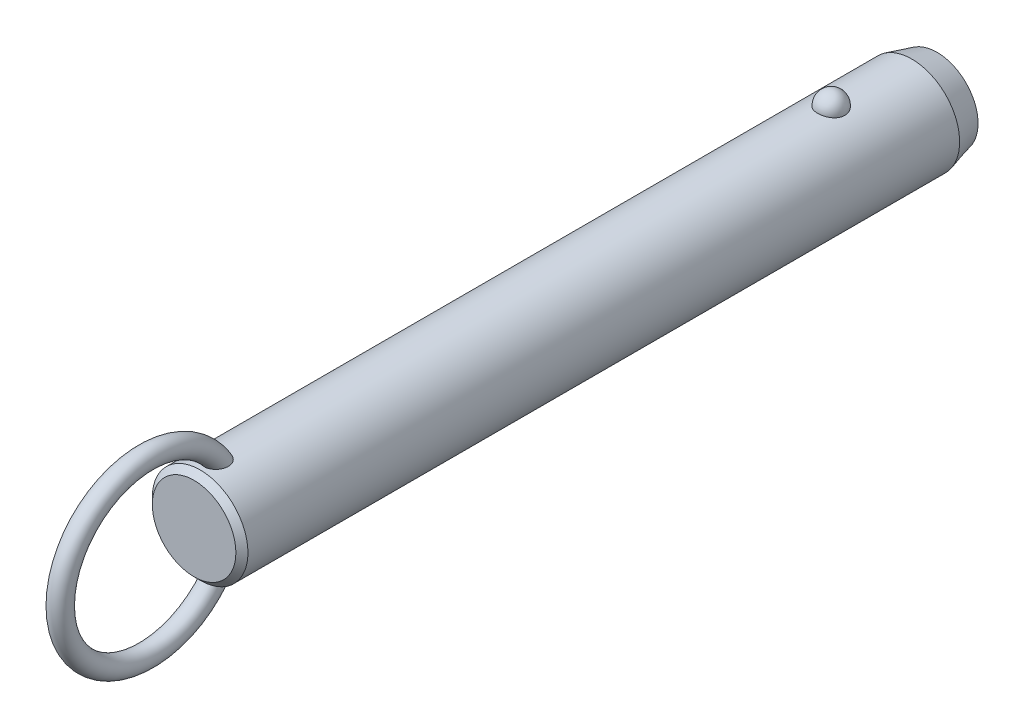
ISO-10303-21;
HEADER;
FILE_DESCRIPTION(('STEP AP214'),'2;1');
FILE_NAME('part.step','',(''),(''),'','','');
FILE_SCHEMA(('AUTOMOTIVE_DESIGN { 1 0 10303 214 1 1 1 1 }'));
ENDSEC;
DATA;
#1=APPLICATION_CONTEXT('core data for automotive mechanical design processes');
#2=APPLICATION_PROTOCOL_DEFINITION('international standard','automotive_design',2000,#1);
#3=PRODUCT_CONTEXT('',#1,'mechanical');
#4=PRODUCT('Part','Part','',(#3));
#5=PRODUCT_RELATED_PRODUCT_CATEGORY('part','',(#4));
#6=PRODUCT_DEFINITION_FORMATION('','',#4);
#7=PRODUCT_DEFINITION_CONTEXT('part definition',#1,'design');
#8=PRODUCT_DEFINITION('design','',#6,#7);
#9=PRODUCT_DEFINITION_SHAPE('','',#8);
#10=(LENGTH_UNIT() NAMED_UNIT(*) SI_UNIT(.MILLI.,.METRE.));
#11=(NAMED_UNIT(*) PLANE_ANGLE_UNIT() SI_UNIT($,.RADIAN.));
#12=(NAMED_UNIT(*) SI_UNIT($,.STERADIAN.) SOLID_ANGLE_UNIT());
#13=UNCERTAINTY_MEASURE_WITH_UNIT(LENGTH_MEASURE(1.E-05),#10,'distance_accuracy_value','');
#14=(GEOMETRIC_REPRESENTATION_CONTEXT(3) GLOBAL_UNCERTAINTY_ASSIGNED_CONTEXT((#13)) GLOBAL_UNIT_ASSIGNED_CONTEXT((#10,
#11,#12)) REPRESENTATION_CONTEXT('',''));
#15=CARTESIAN_POINT('',(0.,0.,0.));
#16=DIRECTION('',(0.,0.,1.));
#17=DIRECTION('',(1.,0.,0.));
#18=AXIS2_PLACEMENT_3D('',#15,#16,#17);
#19=CARTESIAN_POINT('',(0.,0.,114.3));
#20=DIRECTION('',(0.,0.,-1.));
#21=DIRECTION('',(-1.,0.,0.));
#22=AXIS2_PLACEMENT_3D('',#19,#20,#21);
#23=CYLINDRICAL_SURFACE('',#22,9.5);
#24=CARTESIAN_POINT('',(2.67259918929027,9.11631578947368,-2.70000000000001));
#25=CARTESIAN_POINT('',(2.6725968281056,9.11631786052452,-2.54909854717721));
#26=CARTESIAN_POINT('',(2.66030567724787,9.11994722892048,-2.39816735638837));
#27=CARTESIAN_POINT('',(2.6114347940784,9.13405924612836,-2.10058568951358));
#28=CARTESIAN_POINT('',(2.57484658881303,9.14454428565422,-1.95393672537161));
#29=CARTESIAN_POINT('',(2.47830875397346,9.17117631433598,-1.66916069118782));
#30=CARTESIAN_POINT('',(2.41836936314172,9.18732082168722,-1.53102991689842));
#31=CARTESIAN_POINT('',(2.27661331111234,9.22346780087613,-1.26705393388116));
#32=CARTESIAN_POINT('',(2.19479699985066,9.24347021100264,-1.14120852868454));
#33=CARTESIAN_POINT('',(2.01085282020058,9.28522401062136,-0.904632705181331));
#34=CARTESIAN_POINT('',(1.90862396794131,9.30698376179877,-0.793982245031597));
#35=CARTESIAN_POINT('',(1.6867437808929,9.34973971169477,-0.591607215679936));
#36=CARTESIAN_POINT('',(1.56709244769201,9.37073591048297,-0.499882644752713));
#37=CARTESIAN_POINT('',(1.31393976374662,9.40956370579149,-0.338167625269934));
#38=CARTESIAN_POINT('',(1.18048026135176,9.42740444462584,-0.268113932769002));
#39=CARTESIAN_POINT('',(0.903154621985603,9.45799906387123,-0.151390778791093));
#40=CARTESIAN_POINT('',(0.759289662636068,9.47075351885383,-0.104718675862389));
#41=CARTESIAN_POINT('',(0.468074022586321,9.48956256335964,-0.0367633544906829));
#42=CARTESIAN_POINT('',(0.320836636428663,9.49573643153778,-0.0150275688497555));
#43=CARTESIAN_POINT('',(0.0246714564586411,9.50112183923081,0.00396199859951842));
#44=CARTESIAN_POINT('',(-0.124256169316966,9.50033406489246,0.00121819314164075));
#45=CARTESIAN_POINT('',(-0.417264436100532,9.4919475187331,-0.0284441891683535));
#46=CARTESIAN_POINT('',(-0.56138413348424,9.48444885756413,-0.0550074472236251));
#47=CARTESIAN_POINT('',(-0.842986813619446,9.46357853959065,-0.131064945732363));
#48=CARTESIAN_POINT('',(-0.980469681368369,9.450206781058,-0.180559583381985));
#49=CARTESIAN_POINT('',(-1.24585005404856,9.41890822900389,-0.301476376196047));
#50=CARTESIAN_POINT('',(-1.37368611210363,9.40095498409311,-0.373026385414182));
#51=CARTESIAN_POINT('',(-1.61552738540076,9.36242964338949,-0.536025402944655));
#52=CARTESIAN_POINT('',(-1.72953116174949,9.34185727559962,-0.627476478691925));
#53=CARTESIAN_POINT('',(-1.9429225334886,9.29984568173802,-0.829844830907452));
#54=CARTESIAN_POINT('',(-2.04198021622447,9.27839736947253,-0.94110821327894));
#55=CARTESIAN_POINT('',(-2.22026460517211,9.23735994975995,-1.17883414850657));
#56=CARTESIAN_POINT('',(-2.29948985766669,9.21777097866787,-1.30529781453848));
#57=CARTESIAN_POINT('',(-2.43697287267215,9.18238994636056,-1.57158566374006));
#58=CARTESIAN_POINT('',(-2.49497068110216,9.16664569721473,-1.71155057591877));
#59=CARTESIAN_POINT('',(-2.5872073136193,9.14104303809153,-1.99961197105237));
#60=CARTESIAN_POINT('',(-2.62144683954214,9.13118445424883,-2.14770821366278));
#61=CARTESIAN_POINT('',(-2.66521466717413,9.11850622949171,-2.44715424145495));
#62=CARTESIAN_POINT('',(-2.67484831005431,9.11565658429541,-2.59848735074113));
#63=CARTESIAN_POINT('',(-2.66946735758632,9.11723375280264,-2.90067317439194));
#64=CARTESIAN_POINT('',(-2.65445345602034,9.12166036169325,-3.05152590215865));
#65=CARTESIAN_POINT('',(-2.60029711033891,9.13724422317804,-3.34766110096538));
#66=CARTESIAN_POINT('',(-2.56127978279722,9.14836656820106,-3.49296833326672));
#67=CARTESIAN_POINT('',(-2.46018844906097,9.17606676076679,-3.77477535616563));
#68=CARTESIAN_POINT('',(-2.39811349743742,9.1926448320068,-3.9112747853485));
#69=CARTESIAN_POINT('',(-2.25202303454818,9.22952198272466,-4.17244273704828));
#70=CARTESIAN_POINT('',(-2.16788714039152,9.24984129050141,-4.29704106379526));
#71=CARTESIAN_POINT('',(-1.9799408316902,9.29188255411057,-4.53013066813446));
#72=CARTESIAN_POINT('',(-1.87612963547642,9.31360456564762,-4.63862130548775));
#73=CARTESIAN_POINT('',(-1.65105429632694,9.35612959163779,-4.8369029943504));
#74=CARTESIAN_POINT('',(-1.52972405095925,9.37692871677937,-4.92661991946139));
#75=CARTESIAN_POINT('',(-1.27318250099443,9.41518970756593,-5.08429106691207));
#76=CARTESIAN_POINT('',(-1.13797219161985,9.432651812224,-5.15224684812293));
#77=CARTESIAN_POINT('',(-0.859280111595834,9.46208255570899,-5.26371827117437));
#78=CARTESIAN_POINT('',(-0.715925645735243,9.47411833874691,-5.30753421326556));
#79=CARTESIAN_POINT('',(-0.423550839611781,9.4916822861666,-5.37076321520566));
#80=CARTESIAN_POINT('',(-0.2745312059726,9.49721125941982,-5.39017930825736));
#81=CARTESIAN_POINT('',(0.0218446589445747,9.50110860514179,-5.40390587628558));
#82=CARTESIAN_POINT('',(0.16917707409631,9.49961381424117,-5.39869609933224));
#83=CARTESIAN_POINT('',(0.460808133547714,9.48993906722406,-5.36441955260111));
#84=CARTESIAN_POINT('',(0.605106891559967,9.48175936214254,-5.33535367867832));
#85=CARTESIAN_POINT('',(0.886027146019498,9.4596376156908,-5.25435587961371));
#86=CARTESIAN_POINT('',(1.02267710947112,9.44571881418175,-5.20251612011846));
#87=CARTESIAN_POINT('',(1.28523827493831,9.41358993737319,-5.07741549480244));
#88=CARTESIAN_POINT('',(1.41114877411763,9.39537958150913,-5.00415322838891));
#89=CARTESIAN_POINT('',(1.65085227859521,9.3562644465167,-4.83684599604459));
#90=CARTESIAN_POINT('',(1.76442346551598,9.33532178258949,-4.74249218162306));
#91=CARTESIAN_POINT('',(1.97425672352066,9.29321198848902,-4.53620389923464));
#92=CARTESIAN_POINT('',(2.07051582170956,9.27204482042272,-4.42426641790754));
#93=CARTESIAN_POINT('',(2.24490086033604,9.23139221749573,-4.18363183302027));
#94=CARTESIAN_POINT('',(2.32267019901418,9.21194380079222,-4.05466990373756));
#95=CARTESIAN_POINT('',(2.45584092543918,9.1773419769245,-3.78517836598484));
#96=CARTESIAN_POINT('',(2.5112497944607,9.16218713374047,-3.64465264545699));
#97=CARTESIAN_POINT('',(2.59380876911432,9.13913522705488,-3.37104301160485));
#98=CARTESIAN_POINT('',(2.62330266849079,9.13064624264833,-3.23871053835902));
#99=CARTESIAN_POINT('',(2.66269870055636,9.11923566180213,-2.97092664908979));
#100=CARTESIAN_POINT('',(2.67260130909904,9.11631393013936,-2.83547530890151));
#101=CARTESIAN_POINT('',(2.67259918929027,9.11631578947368,-2.70000000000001));
#102=B_SPLINE_CURVE_WITH_KNOTS('',3,(#24,#25,#26,#27,#28,#29,#30,#31,#32,#33,#34,#35,#36,#37,
#38,#39,#40,#41,#42,#43,#44,#45,#46,#47,#48,#49,#50,#51,#52,#53,#54,#55,#56,#57,#58,#59,#60,#61,
#62,#63,#64,#65,#66,#67,#68,#69,#70,#71,#72,#73,#74,#75,#76,#77,#78,#79,#80,#81,#82,#83,#84,#85,
#86,#87,#88,#89,#90,#91,#92,#93,#94,#95,#96,#97,#98,#99,#100,#101),.UNSPECIFIED.,.T.,.F.,(4,2,2,
2,2,2,2,2,2,2,2,2,2,2,2,2,2,2,2,2,2,2,2,2,2,2,2,2,2,2,2,2,2,2,2,2,2,2,4),(0.,0.452217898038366,
0.904593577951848,1.35677112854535,1.80894144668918,2.26340676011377,2.71787203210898,
3.17099820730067,3.62407318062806,4.0687883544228,4.51345969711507,4.95160616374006,
5.38976021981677,5.83050358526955,6.27129275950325,6.72071308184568,7.17016633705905,
7.62495278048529,8.07972578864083,8.53254856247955,8.98535859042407,9.43582813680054,
9.88631615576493,10.3393155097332,10.7923328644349,11.2471065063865,11.7018475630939,
12.150795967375,12.599688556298,13.0398725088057,13.4800399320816,13.9184421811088,
14.3568730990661,14.802202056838,15.2476074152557,15.7010097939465,16.1542603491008,
16.5602594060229,16.966248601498),.UNSPECIFIED.);
#103=CARTESIAN_POINT('',(2.67259918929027,9.11631578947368,-2.70000000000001));
#104=VERTEX_POINT('',#103);
#105=EDGE_CURVE('E41',#104,#104,#102,.T.);
#106=ORIENTED_EDGE('',*,*,#105,.T.);
#107=EDGE_LOOP('',(#106));
#108=FACE_BOUND('',#107,.T.);
#109=CARTESIAN_POINT('',(0.,0.,122.62));
#110=DIRECTION('',(0.,0.,1.));
#111=DIRECTION('',(1.,0.,0.));
#112=AXIS2_PLACEMENT_3D('',#109,#110,#111);
#113=CIRCLE('',#112,9.5);
#114=CARTESIAN_POINT('',(9.5,0.,122.62));
#115=VERTEX_POINT('',#114);
#116=EDGE_CURVE('E10',#115,#115,#113,.F.);
#117=ORIENTED_EDGE('',*,*,#116,.T.);
#118=EDGE_LOOP('',(#117));
#119=FACE_BOUND('',#118,.T.);
#120=CARTESIAN_POINT('',(-0.697062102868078,-9.47439269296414,116.967808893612));
#121=CARTESIAN_POINT('',(-0.799579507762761,-9.46685146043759,117.007482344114));
#122=CARTESIAN_POINT('',(-0.898575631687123,-9.45788043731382,117.0559309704));
#123=CARTESIAN_POINT('',(-1.08670047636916,-9.43811593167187,117.168868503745));
#124=CARTESIAN_POINT('',(-1.17583204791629,-9.42732297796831,117.233352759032));
#125=CARTESIAN_POINT('',(-1.34179806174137,-9.40513672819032,117.376209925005));
#126=CARTESIAN_POINT('',(-1.41865133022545,-9.39374438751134,117.454561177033));
#127=CARTESIAN_POINT('',(-1.55860047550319,-9.37154196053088,117.622752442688));
#128=CARTESIAN_POINT('',(-1.62169476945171,-9.3607319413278,117.71259377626));
#129=CARTESIAN_POINT('',(-1.73527695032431,-9.34035749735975,117.904500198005));
#130=CARTESIAN_POINT('',(-1.78522266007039,-9.33085270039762,118.006891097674));
#131=CARTESIAN_POINT('',(-1.86924997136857,-9.3143834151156,118.218148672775));
#132=CARTESIAN_POINT('',(-1.90332570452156,-9.30741986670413,118.327017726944));
#133=CARTESIAN_POINT('',(-1.95893603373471,-9.29588482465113,118.560473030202));
#134=CARTESIAN_POINT('',(-1.97872420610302,-9.29165182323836,118.685489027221));
#135=CARTESIAN_POINT('',(-2.00062129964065,-9.28695978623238,118.937080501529));
#136=CARTESIAN_POINT('',(-2.00272284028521,-9.28650232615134,119.063656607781));
#137=CARTESIAN_POINT('',(-1.98958876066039,-9.28932750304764,119.336815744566));
#138=CARTESIAN_POINT('',(-1.97143366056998,-9.2932400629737,119.483251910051));
#139=CARTESIAN_POINT('',(-1.91479925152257,-9.30507151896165,119.772062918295));
#140=CARTESIAN_POINT('',(-1.87629122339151,-9.31299607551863,119.914431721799));
#141=CARTESIAN_POINT('',(-1.7722568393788,-9.33340232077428,120.215172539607));
#142=CARTESIAN_POINT('',(-1.70334898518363,-9.34641636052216,120.372369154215));
#143=CARTESIAN_POINT('',(-1.58111062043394,-9.36759153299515,120.597517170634));
#144=CARTESIAN_POINT('',(-1.53721459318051,-9.37492619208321,120.670796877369));
#145=CARTESIAN_POINT('',(-1.4430263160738,-9.38988566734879,120.81307405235));
#146=CARTESIAN_POINT('',(-1.39273721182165,-9.39751033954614,120.882073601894));
#147=CARTESIAN_POINT('',(-1.26775962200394,-9.41530678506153,121.036983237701));
#148=CARTESIAN_POINT('',(-1.19052326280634,-9.42548108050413,121.120871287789));
#149=CARTESIAN_POINT('',(-1.0242024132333,-9.44499825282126,121.276008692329));
#150=CARTESIAN_POINT('',(-0.935139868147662,-9.45434261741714,121.347280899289));
#151=CARTESIAN_POINT('',(-0.766610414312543,-9.46930670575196,121.458695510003));
#152=CARTESIAN_POINT('',(-0.689439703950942,-9.47529223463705,121.502235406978));
#153=CARTESIAN_POINT('',(-0.528942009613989,-9.48560294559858,121.57631336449));
#154=CARTESIAN_POINT('',(-0.445620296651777,-9.48992953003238,121.606862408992));
#155=CARTESIAN_POINT('',(-0.273901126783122,-9.49644161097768,121.652579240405));
#156=CARTESIAN_POINT('',(-0.185465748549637,-9.49860811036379,121.66761059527));
#157=CARTESIAN_POINT('',(-0.00734541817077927,-9.5004135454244,121.680149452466));
#158=CARTESIAN_POINT('',(0.0823387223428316,-9.50005405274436,121.677667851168));
#159=CARTESIAN_POINT('',(0.247679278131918,-9.49708301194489,121.656995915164));
#160=CARTESIAN_POINT('',(0.32362017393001,-9.49477609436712,121.640930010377));
#161=CARTESIAN_POINT('',(0.47198153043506,-9.48855917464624,121.597172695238));
#162=CARTESIAN_POINT('',(0.54440029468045,-9.48464840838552,121.569475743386));
#163=CARTESIAN_POINT('',(0.708947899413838,-9.47398336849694,121.49280266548));
#164=CARTESIAN_POINT('',(0.799149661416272,-9.46671310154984,121.439774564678));
#165=CARTESIAN_POINT('',(0.969783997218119,-9.45076225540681,121.319973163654));
#166=CARTESIAN_POINT('',(1.05019415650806,-9.44207854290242,121.253169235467));
#167=CARTESIAN_POINT('',(1.23092343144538,-9.42051459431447,121.080759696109));
#168=CARTESIAN_POINT('',(1.32652499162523,-9.40733378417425,120.97026193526));
#169=CARTESIAN_POINT('',(1.49893121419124,-9.3814074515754,120.735561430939));
#170=CARTESIAN_POINT('',(1.57571616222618,-9.36866239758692,120.611344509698));
#171=CARTESIAN_POINT('',(1.71285426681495,-9.34457644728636,120.349389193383));
#172=CARTESIAN_POINT('',(1.7726636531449,-9.33328726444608,120.21136233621));
#173=CARTESIAN_POINT('',(1.87239208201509,-9.31379209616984,119.928051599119));
#174=CARTESIAN_POINT('',(1.91230158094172,-9.3055875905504,119.782764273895));
#175=CARTESIAN_POINT('',(1.97604189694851,-9.29228394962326,119.462028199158));
#176=CARTESIAN_POINT('',(1.99587438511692,-9.28797202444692,119.285724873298));
#177=CARTESIAN_POINT('',(2.0029570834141,-9.28645519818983,118.932414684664));
#178=CARTESIAN_POINT('',(1.99025930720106,-9.28923895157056,118.755409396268));
#179=CARTESIAN_POINT('',(1.93735479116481,-9.30038134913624,118.456338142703));
#180=CARTESIAN_POINT('',(1.90576827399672,-9.30697680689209,118.332667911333));
#181=CARTESIAN_POINT('',(1.82287484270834,-9.32356855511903,118.092329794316));
#182=CARTESIAN_POINT('',(1.77158213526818,-9.33356239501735,117.975656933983));
#183=CARTESIAN_POINT('',(1.64885744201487,-9.35602275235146,117.752706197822));
#184=CARTESIAN_POINT('',(1.57730995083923,-9.36850332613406,117.646492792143));
#185=CARTESIAN_POINT('',(1.41543264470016,-9.39431873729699,117.449553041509));
#186=CARTESIAN_POINT('',(1.3251088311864,-9.40765330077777,117.358821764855));
#187=CARTESIAN_POINT('',(1.13846223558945,-9.43195720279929,117.205033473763));
#188=CARTESIAN_POINT('',(1.04369890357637,-9.44302894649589,117.140094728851));
#189=CARTESIAN_POINT('',(0.84396568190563,-9.46296805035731,117.028038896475));
#190=CARTESIAN_POINT('',(0.73900000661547,-9.4718363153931,116.980914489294));
#191=CARTESIAN_POINT('',(0.52817529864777,-9.48586140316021,116.908117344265));
#192=CARTESIAN_POINT('',(0.422686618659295,-9.49119633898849,116.88140249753));
#193=CARTESIAN_POINT('',(0.208590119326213,-9.49831365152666,116.846013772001));
#194=CARTESIAN_POINT('',(0.0999817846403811,-9.500095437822,116.837342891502));
#195=CARTESIAN_POINT('',(-0.126104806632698,-9.49988861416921,116.838350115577));
#196=CARTESIAN_POINT('',(-0.243578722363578,-9.49757821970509,116.849594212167));
#197=CARTESIAN_POINT('',(-0.474390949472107,-9.48885165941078,116.893167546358));
#198=CARTESIAN_POINT('',(-0.587729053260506,-9.48243528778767,116.925497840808));
#199=CARTESIAN_POINT('',(-0.697062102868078,-9.47439269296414,116.967808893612));
#200=B_SPLINE_CURVE_WITH_KNOTS('',3,(#120,#121,#122,#123,#124,#125,#126,#127,#128,#129,#130,
#131,#132,#133,#134,#135,#136,#137,#138,#139,#140,#141,#142,#143,#144,#145,#146,#147,#148,#149,
#150,#151,#152,#153,#154,#155,#156,#157,#158,#159,#160,#161,#162,#163,#164,#165,#166,#167,#168,
#169,#170,#171,#172,#173,#174,#175,#176,#177,#178,#179,#180,#181,#182,#183,#184,#185,#186,#187,
#188,#189,#190,#191,#192,#193,#194,#195,#196,#197,#198,#199),.UNSPECIFIED.,.T.,.F.,(4,2,2,2,2,2,
2,2,2,2,2,2,2,2,2,2,2,2,2,2,2,2,2,2,2,2,2,2,2,2,2,2,2,2,2,2,2,2,2,4),(0.,0.330119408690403,
0.660143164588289,0.98965593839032,1.31920659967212,1.66074728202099,2.00241415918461,
2.3808869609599,2.7595176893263,3.20065679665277,3.64242004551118,4.15620996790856,
4.41314162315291,4.66994734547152,5.0122866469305,5.35399933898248,5.61943037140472,
5.88463652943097,6.15215502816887,6.41950709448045,6.6514439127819,6.88349136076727,
7.19641200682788,7.51003602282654,7.94779711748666,8.38601491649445,8.83699707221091,
9.28819530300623,9.81778662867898,10.3465317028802,10.7284172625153,11.1100280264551,
11.4938603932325,11.8775702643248,12.2220189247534,12.5663259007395,12.8915939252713,
13.2169159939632,13.5689650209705,13.9210316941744),.UNSPECIFIED.);
#201=CARTESIAN_POINT('',(-0.697062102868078,-9.47439269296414,116.967808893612));
#202=VERTEX_POINT('',#201);
#203=EDGE_CURVE('E60',#202,#202,#200,.T.);
#204=ORIENTED_EDGE('',*,*,#203,.T.);
#205=EDGE_LOOP('',(#204));
#206=FACE_BOUND('',#205,.T.);
#207=CARTESIAN_POINT('',(-0.697062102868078,9.47439269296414,116.967808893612));
#208=CARTESIAN_POINT('',(-0.597792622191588,9.48169483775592,116.92939564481));
#209=CARTESIAN_POINT('',(-0.495106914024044,9.48766580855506,116.899168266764));
#210=CARTESIAN_POINT('',(-0.285876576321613,9.49627648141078,116.856032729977));
#211=CARTESIAN_POINT('',(-0.179324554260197,9.49890941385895,116.843159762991));
#212=CARTESIAN_POINT('',(0.0344157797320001,9.50053798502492,116.835166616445));
#213=CARTESIAN_POINT('',(0.141603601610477,9.49953613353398,116.840034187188));
#214=CARTESIAN_POINT('',(0.353563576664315,9.49401038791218,116.867365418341));
#215=CARTESIAN_POINT('',(0.458336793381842,9.48948807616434,116.88982117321));
#216=CARTESIAN_POINT('',(0.66249373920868,9.4774236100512,116.951671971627));
#217=CARTESIAN_POINT('',(0.761881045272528,9.46988348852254,116.991055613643));
#218=CARTESIAN_POINT('',(0.952608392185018,9.45260382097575,117.085634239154));
#219=CARTESIAN_POINT('',(1.04394806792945,9.44286417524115,117.140829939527));
#220=CARTESIAN_POINT('',(1.21712767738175,9.4221176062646,117.266066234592));
#221=CARTESIAN_POINT('',(1.29885671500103,9.41109835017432,117.336257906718));
#222=CARTESIAN_POINT('',(1.4497897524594,9.38903310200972,117.488980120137));
#223=CARTESIAN_POINT('',(1.51899278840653,9.37798710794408,117.571511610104));
#224=CARTESIAN_POINT('',(1.64602857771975,9.35654375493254,117.749776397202));
#225=CARTESIAN_POINT('',(1.70333052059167,9.34618688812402,117.845891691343));
#226=CARTESIAN_POINT('',(1.80259341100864,9.32755128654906,118.045897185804));
#227=CARTESIAN_POINT('',(1.84454942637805,9.31927322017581,118.149789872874));
#228=CARTESIAN_POINT('',(1.91637039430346,9.30478365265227,118.372213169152));
#229=CARTESIAN_POINT('',(1.944805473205,9.29882552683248,118.491219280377));
#230=CARTESIAN_POINT('',(1.98449865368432,9.29043398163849,118.732143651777));
#231=CARTESIAN_POINT('',(1.99574908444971,9.28800213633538,118.854063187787));
#232=CARTESIAN_POINT('',(2.00275141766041,9.28649645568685,119.116932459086));
#233=CARTESIAN_POINT('',(1.99588238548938,9.28799035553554,119.257952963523));
#234=CARTESIAN_POINT('',(1.96270559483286,9.29505517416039,119.537621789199));
#235=CARTESIAN_POINT('',(1.93637872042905,9.30063010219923,119.676267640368));
#236=CARTESIAN_POINT('',(1.85949176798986,9.31633564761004,119.972561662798));
#237=CARTESIAN_POINT('',(1.80549792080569,9.3270926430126,120.129290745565));
#238=CARTESIAN_POINT('',(1.67376869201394,9.3516306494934,120.432284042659));
#239=CARTESIAN_POINT('',(1.5960318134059,9.36541185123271,120.578547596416));
#240=CARTESIAN_POINT('',(1.4360277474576,9.39110706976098,120.825813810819));
#241=CARTESIAN_POINT('',(1.35831795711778,9.40278656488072,120.929791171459));
#242=CARTESIAN_POINT('',(1.18774483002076,9.42585025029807,121.124534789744));
#243=CARTESIAN_POINT('',(1.09490932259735,9.43723493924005,121.215324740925));
#244=CARTESIAN_POINT('',(0.921110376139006,9.45552616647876,121.35620334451));
#245=CARTESIAN_POINT('',(0.843738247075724,9.46281058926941,121.410656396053));
#246=CARTESIAN_POINT('',(0.681245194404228,9.47589120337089,121.506711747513));
#247=CARTESIAN_POINT('',(0.596135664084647,9.48168953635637,121.548332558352));
#248=CARTESIAN_POINT('',(0.433779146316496,9.49038144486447,121.610089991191));
#249=CARTESIAN_POINT('',(0.35745955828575,9.49359170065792,121.63260136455));
#250=CARTESIAN_POINT('',(0.202074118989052,9.49816761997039,121.664574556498));
#251=CARTESIAN_POINT('',(0.123010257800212,9.49953459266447,121.674045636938));
#252=CARTESIAN_POINT('',(-0.035737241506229,9.50026497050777,121.679114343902));
#253=CARTESIAN_POINT('',(-0.115421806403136,9.49962433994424,121.674684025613));
#254=CARTESIAN_POINT('',(-0.272823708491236,9.49640854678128,121.652296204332));
#255=CARTESIAN_POINT('',(-0.350540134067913,9.4938325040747,121.634332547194));
#256=CARTESIAN_POINT('',(-0.500580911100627,9.4870946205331,121.586802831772));
#257=CARTESIAN_POINT('',(-0.572979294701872,9.48296359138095,121.557461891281));
#258=CARTESIAN_POINT('',(-0.712864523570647,9.47347609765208,121.489008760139));
#259=CARTESIAN_POINT('',(-0.780349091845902,9.46811906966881,121.449892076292));
#260=CARTESIAN_POINT('',(-0.946309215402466,9.45329720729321,121.339432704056));
#261=CARTESIAN_POINT('',(-1.04090230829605,9.44321512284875,121.262329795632));
#262=CARTESIAN_POINT('',(-1.21661929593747,9.42219227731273,121.09409718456));
#263=CARTESIAN_POINT('',(-1.29770519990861,9.41124921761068,121.002929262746));
#264=CARTESIAN_POINT('',(-1.4731964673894,9.38563439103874,120.776162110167));
#265=CARTESIAN_POINT('',(-1.56208878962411,9.37102009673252,120.636289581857));
#266=CARTESIAN_POINT('',(-1.71623987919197,9.34401559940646,120.343950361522));
#267=CARTESIAN_POINT('',(-1.78147866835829,9.33162728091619,120.191473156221));
#268=CARTESIAN_POINT('',(-1.88853837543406,9.31055541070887,119.875647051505));
#269=CARTESIAN_POINT('',(-1.92998995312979,9.30193076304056,119.712168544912));
#270=CARTESIAN_POINT('',(-1.98590726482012,9.29015757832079,119.380526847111));
#271=CARTESIAN_POINT('',(-2.00040705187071,9.2870021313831,119.212369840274));
#272=CARTESIAN_POINT('',(-1.99964701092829,9.28716218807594,118.905080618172));
#273=CARTESIAN_POINT('',(-1.98908145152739,9.28945704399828,118.765936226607));
#274=CARTESIAN_POINT('',(-1.94566294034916,9.29865169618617,118.491153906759));
#275=CARTESIAN_POINT('',(-1.91282062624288,9.30554929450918,118.355514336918));
#276=CARTESIAN_POINT('',(-1.84582133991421,9.31898248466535,118.157802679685));
#277=CARTESIAN_POINT('',(-1.82038084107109,9.32400364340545,118.092583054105));
#278=CARTESIAN_POINT('',(-1.76350511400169,9.33492884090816,117.964903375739));
#279=CARTESIAN_POINT('',(-1.73207305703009,9.3408324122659,117.902441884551));
#280=CARTESIAN_POINT('',(-1.66324243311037,9.353333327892,117.78094078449));
#281=CARTESIAN_POINT('',(-1.62584239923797,9.35993084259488,117.721902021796));
#282=CARTESIAN_POINT('',(-1.545276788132,9.37356864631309,117.607987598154));
#283=CARTESIAN_POINT('',(-1.50211241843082,9.38060884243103,117.553111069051));
#284=CARTESIAN_POINT('',(-1.37681147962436,9.40004442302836,117.409961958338));
#285=CARTESIAN_POINT('',(-1.28916358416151,9.41261047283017,117.326429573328));
#286=CARTESIAN_POINT('',(-1.09996826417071,9.43658180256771,117.177236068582));
#287=CARTESIAN_POINT('',(-0.998461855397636,9.44799034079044,117.111523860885));
#288=CARTESIAN_POINT('',(-0.860188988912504,9.46103017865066,117.0394367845));
#289=CARTESIAN_POINT('',(-0.828141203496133,9.46389141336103,117.023851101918));
#290=CARTESIAN_POINT('',(-0.763210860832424,9.46934915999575,116.994473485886));
#291=CARTESIAN_POINT('',(-0.730328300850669,9.47194567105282,116.980681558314));
#292=CARTESIAN_POINT('',(-0.697062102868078,9.47439269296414,116.967808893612));
#293=B_SPLINE_CURVE_WITH_KNOTS('',3,(#207,#208,#209,#210,#211,#212,#213,#214,#215,#216,#217,
#218,#219,#220,#221,#222,#223,#224,#225,#226,#227,#228,#229,#230,#231,#232,#233,#234,#235,#236,
#237,#238,#239,#240,#241,#242,#243,#244,#245,#246,#247,#248,#249,#250,#251,#252,#253,#254,#255,
#256,#257,#258,#259,#260,#261,#262,#263,#264,#265,#266,#267,#268,#269,#270,#271,#272,#273,#274,
#275,#276,#277,#278,#279,#280,#281,#282,#283,#284,#285,#286,#287,#288,#289,#290,#291,#292),
.UNSPECIFIED.,.T.,.F.,(4,2,2,2,2,2,2,2,2,2,2,2,2,2,2,2,2,2,2,2,2,2,2,2,2,2,2,2,2,2,2,2,2,2,2,2,
2,2,2,2,2,2,4),(0.,0.319942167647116,0.640532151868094,0.96090081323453,1.28112555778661,
1.60113495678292,1.92115886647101,2.24457323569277,2.56801248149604,2.90371927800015,
3.23953387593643,3.60560313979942,3.97183576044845,4.39383693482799,4.81625324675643,
5.31257045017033,5.80891895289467,6.19868344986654,6.58773876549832,6.87145417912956,
7.15475838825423,7.3926375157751,7.63034760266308,7.8685358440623,8.10683246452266,
8.34063661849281,8.57454843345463,8.93983939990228,9.30614105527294,9.80266668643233,
10.2996107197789,10.8040753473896,11.3079021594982,11.7249776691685,12.1418541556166,
12.3521485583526,12.562331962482,12.7725671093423,12.9827582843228,13.3458276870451,
13.7078449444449,13.8150604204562,13.9222762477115),.UNSPECIFIED.);
#294=CARTESIAN_POINT('',(-0.697062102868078,9.47439269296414,116.967808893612));
#295=VERTEX_POINT('',#294);
#296=EDGE_CURVE('E67',#295,#295,#293,.T.);
#297=ORIENTED_EDGE('',*,*,#296,.T.);
#298=EDGE_LOOP('',(#297));
#299=FACE_BOUND('',#298,.T.);
#300=CARTESIAN_POINT('',(0.,0.,-18.6999999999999));
#301=DIRECTION('',(0.,0.,-1.));
#302=DIRECTION('',(-1.,0.,0.));
#303=AXIS2_PLACEMENT_3D('',#300,#301,#302);
#304=CIRCLE('',#303,9.5);
#305=CARTESIAN_POINT('',(-9.5,0.,-18.6999999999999));
#306=VERTEX_POINT('',#305);
#307=EDGE_CURVE('E57',#306,#306,#304,.F.);
#308=ORIENTED_EDGE('',*,*,#307,.T.);
#309=EDGE_LOOP('',(#308));
#310=FACE_BOUND('',#309,.T.);
#311=ADVANCED_FACE('F37',(#108,#119,#206,#299,#310),#23,.T.);
#312=CARTESIAN_POINT('',(0.,0.,-23.7));
#313=DIRECTION('',(0.,0.,-1.));
#314=DIRECTION('',(-1.,0.,0.));
#315=AXIS2_PLACEMENT_3D('',#312,#313,#314);
#316=PLANE('',#315);
#317=CARTESIAN_POINT('',(0.,0.,-23.7));
#318=DIRECTION('',(0.,0.,-1.));
#319=DIRECTION('',(-1.,0.,0.));
#320=AXIS2_PLACEMENT_3D('',#317,#318,#319);
#321=CIRCLE('',#320,8.16025403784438);
#322=CARTESIAN_POINT('',(-8.16025403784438,0.,-23.7));
#323=VERTEX_POINT('',#322);
#324=EDGE_CURVE('E66',#323,#323,#321,.T.);
#325=ORIENTED_EDGE('',*,*,#324,.T.);
#326=EDGE_LOOP('',(#325));
#327=FACE_BOUND('',#326,.T.);
#328=ADVANCED_FACE('F85',(#327),#316,.T.);
#329=CARTESIAN_POINT('',(0.,0.,-23.7));
#330=DIRECTION('',(0.,0.,1.));
#331=DIRECTION('',(1.,0.,0.));
#332=AXIS2_PLACEMENT_3D('',#329,#330,#331);
#333=CONICAL_SURFACE('',#332,8.16025403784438,0.261799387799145);
#334=ORIENTED_EDGE('',*,*,#307,.F.);
#335=EDGE_LOOP('',(#334));
#336=FACE_BOUND('',#335,.T.);
#337=ORIENTED_EDGE('',*,*,#324,.F.);
#338=EDGE_LOOP('',(#337));
#339=FACE_BOUND('',#338,.T.);
#340=ADVANCED_FACE('F83',(#336,#339),#333,.T.);
#341=CARTESIAN_POINT('',(0.,0.,123.82));
#342=DIRECTION('',(0.,0.,1.));
#343=DIRECTION('',(1.,0.,0.));
#344=AXIS2_PLACEMENT_3D('',#341,#342,#343);
#345=PLANE('',#344);
#346=CARTESIAN_POINT('',(0.,0.,123.82));
#347=DIRECTION('',(0.,0.,1.));
#348=DIRECTION('',(1.,0.,0.));
#349=AXIS2_PLACEMENT_3D('',#346,#347,#348);
#350=CIRCLE('',#349,8.29999999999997);
#351=CARTESIAN_POINT('',(8.29999999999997,0.,123.82));
#352=VERTEX_POINT('',#351);
#353=EDGE_CURVE('E50',#352,#352,#350,.T.);
#354=ORIENTED_EDGE('',*,*,#353,.T.);
#355=EDGE_LOOP('',(#354));
#356=FACE_BOUND('',#355,.T.);
#357=ADVANCED_FACE('F77',(#356),#345,.T.);
#358=CARTESIAN_POINT('',(0.,0.,133.35));
#359=DIRECTION('',(1.,0.,0.));
#360=DIRECTION('',(0.,0.,-1.));
#361=AXIS2_PLACEMENT_3D('',#358,#359,#360);
#362=TOROIDAL_SURFACE('',#361,17.05,2.);
#363=ORIENTED_EDGE('',*,*,#296,.F.);
#364=EDGE_LOOP('',(#363));
#365=FACE_BOUND('',#364,.T.);
#366=ORIENTED_EDGE('',*,*,#203,.F.);
#367=EDGE_LOOP('',(#366));
#368=FACE_BOUND('',#367,.T.);
#369=ADVANCED_FACE('F73',(#365,#368),#362,.T.);
#370=CARTESIAN_POINT('',(0.,0.,123.82));
#371=DIRECTION('',(0.,0.,-1.));
#372=DIRECTION('',(-1.,0.,0.));
#373=AXIS2_PLACEMENT_3D('',#370,#371,#372);
#374=CONICAL_SURFACE('',#373,8.29999999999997,0.785398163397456);
#375=ORIENTED_EDGE('',*,*,#116,.F.);
#376=EDGE_LOOP('',(#375));
#377=FACE_BOUND('',#376,.T.);
#378=ORIENTED_EDGE('',*,*,#353,.F.);
#379=EDGE_LOOP('',(#378));
#380=FACE_BOUND('',#379,.T.);
#381=ADVANCED_FACE('F39',(#377,#380),#374,.T.);
#382=CARTESIAN_POINT('',(0.,9.5,-2.70000000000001));
#383=DIRECTION('',(0.,1.,0.));
#384=DIRECTION('',(0.,0.,-1.));
#385=AXIS2_PLACEMENT_3D('',#382,#383,#384);
#386=SPHERICAL_SURFACE('',#385,2.7);
#387=ORIENTED_EDGE('',*,*,#105,.F.);
#388=EDGE_LOOP('',(#387));
#389=FACE_BOUND('',#388,.T.);
#390=ADVANCED_FACE('F79',(#389),#386,.T.);
#391=CLOSED_SHELL('',(#311,#328,#340,#357,#369,#381,#390));
#392=MANIFOLD_SOLID_BREP('B2',#391);
#393=ADVANCED_BREP_SHAPE_REPRESENTATION('',(#18,#392),#14);
#394=SHAPE_DEFINITION_REPRESENTATION(#9,#393);
ENDSEC;
END-ISO-10303-21;
